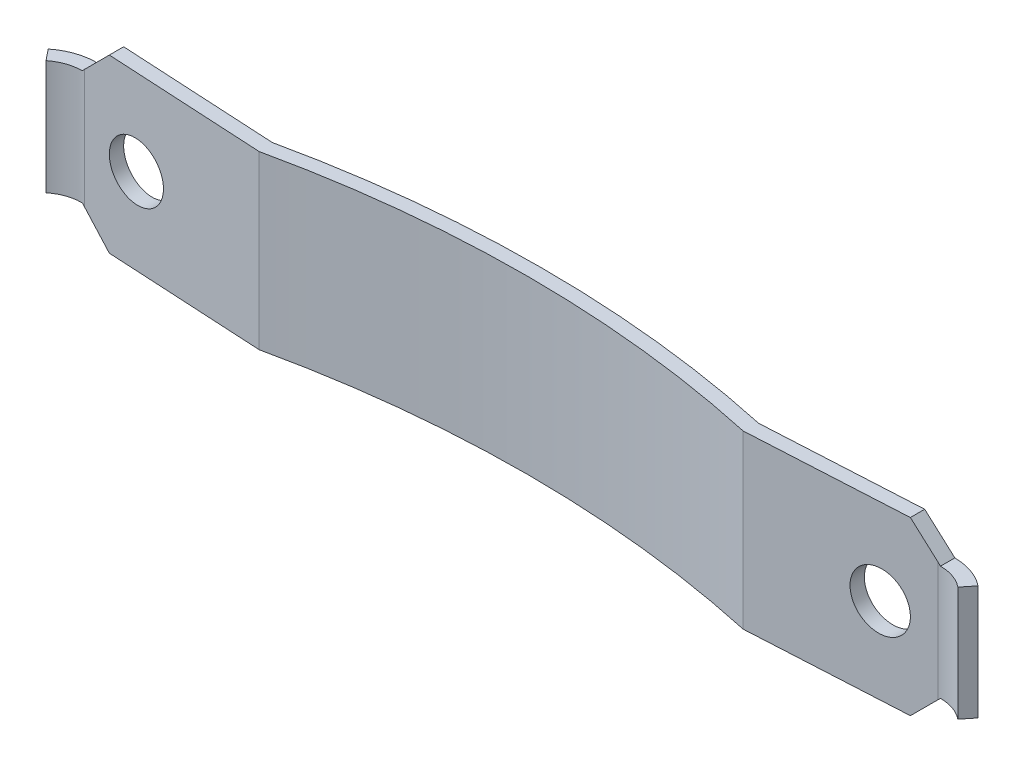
ISO-10303-21;
HEADER;
FILE_DESCRIPTION(('STEP AP214'),'2;1');
FILE_NAME('part.step','',(''),(''),'','','');
FILE_SCHEMA(('AUTOMOTIVE_DESIGN { 1 0 10303 214 1 1 1 1 }'));
ENDSEC;
DATA;
#1=APPLICATION_CONTEXT('core data for automotive mechanical design processes');
#2=APPLICATION_PROTOCOL_DEFINITION('international standard','automotive_design',2000,#1);
#3=PRODUCT_CONTEXT('',#1,'mechanical');
#4=PRODUCT('Part','Part','',(#3));
#5=PRODUCT_RELATED_PRODUCT_CATEGORY('part','',(#4));
#6=PRODUCT_DEFINITION_FORMATION('','',#4);
#7=PRODUCT_DEFINITION_CONTEXT('part definition',#1,'design');
#8=PRODUCT_DEFINITION('design','',#6,#7);
#9=PRODUCT_DEFINITION_SHAPE('','',#8);
#10=(LENGTH_UNIT() NAMED_UNIT(*) SI_UNIT(.MILLI.,.METRE.));
#11=(NAMED_UNIT(*) PLANE_ANGLE_UNIT() SI_UNIT($,.RADIAN.));
#12=(NAMED_UNIT(*) SI_UNIT($,.STERADIAN.) SOLID_ANGLE_UNIT());
#13=UNCERTAINTY_MEASURE_WITH_UNIT(LENGTH_MEASURE(1.E-05),#10,'distance_accuracy_value','');
#14=(GEOMETRIC_REPRESENTATION_CONTEXT(3) GLOBAL_UNCERTAINTY_ASSIGNED_CONTEXT((#13)) GLOBAL_UNIT_ASSIGNED_CONTEXT((#10,
#11,#12)) REPRESENTATION_CONTEXT('',''));
#15=CARTESIAN_POINT('',(0.,0.,0.));
#16=DIRECTION('',(0.,0.,1.));
#17=DIRECTION('',(1.,0.,0.));
#18=AXIS2_PLACEMENT_3D('',#15,#16,#17);
#19=CARTESIAN_POINT('',(15.,3.,1.5612494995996));
#20=DIRECTION('',(0.,-1.,0.));
#21=DIRECTION('',(0.,0.,-1.));
#22=AXIS2_PLACEMENT_3D('',#19,#20,#21);
#23=CYLINDRICAL_SURFACE('',#22,1.5);
#24=CARTESIAN_POINT('',(15.,2.,1.5612494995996));
#25=DIRECTION('',(0.,-1.,0.));
#26=DIRECTION('',(0.,0.,-1.));
#27=AXIS2_PLACEMENT_3D('',#24,#25,#26);
#28=CIRCLE('',#27,1.5);
#29=CARTESIAN_POINT('',(15.9375,2.,0.3903123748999));
#30=VERTEX_POINT('',#29);
#31=CARTESIAN_POINT('',(15.,2.,0.0612494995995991));
#32=VERTEX_POINT('',#31);
#33=EDGE_CURVE('E239',#30,#32,#28,.F.);
#34=ORIENTED_EDGE('',*,*,#33,.T.);
#35=CARTESIAN_POINT('',(15.,2.,1.5612494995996));
#36=DIRECTION('',(-0.707106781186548,-0.707106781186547,0.));
#37=DIRECTION('',(0.707106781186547,-0.707106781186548,0.));
#38=AXIS2_PLACEMENT_3D('',#35,#36,#37);
#39=ELLIPSE('',#38,2.12132034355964,1.5);
#40=CARTESIAN_POINT('',(14.9181314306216,2.08186856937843,0.0634853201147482));
#41=VERTEX_POINT('',#40);
#42=EDGE_CURVE('E179',#32,#41,#39,.F.);
#43=ORIENTED_EDGE('',*,*,#42,.T.);
#44=DIRECTION('',(0.,-1.,0.));
#45=VECTOR('',#44,1.);
#46=CARTESIAN_POINT('',(14.9181314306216,3.,0.0634853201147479));
#47=LINE('',#46,#45);
#48=CARTESIAN_POINT('',(14.9181314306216,-2.08186856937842,0.0634853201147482));
#49=VERTEX_POINT('',#48);
#50=EDGE_CURVE('E178',#41,#49,#47,.T.);
#51=ORIENTED_EDGE('',*,*,#50,.T.);
#52=CARTESIAN_POINT('',(15.,-2.,1.5612494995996));
#53=DIRECTION('',(-0.707106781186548,0.707106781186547,0.));
#54=DIRECTION('',(-0.707106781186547,-0.707106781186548,0.));
#55=AXIS2_PLACEMENT_3D('',#52,#53,#54);
#56=ELLIPSE('',#55,2.12132034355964,1.5);
#57=CARTESIAN_POINT('',(15.,-2.,0.0612494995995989));
#58=VERTEX_POINT('',#57);
#59=EDGE_CURVE('E246',#49,#58,#56,.F.);
#60=ORIENTED_EDGE('',*,*,#59,.T.);
#61=CARTESIAN_POINT('',(15.,-2.,1.5612494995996));
#62=DIRECTION('',(0.,1.,0.));
#63=DIRECTION('',(0.,0.,1.));
#64=AXIS2_PLACEMENT_3D('',#61,#62,#63);
#65=CIRCLE('',#64,1.5);
#66=CARTESIAN_POINT('',(15.9375,-2.,0.3903123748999));
#67=VERTEX_POINT('',#66);
#68=EDGE_CURVE('E257',#58,#67,#65,.F.);
#69=ORIENTED_EDGE('',*,*,#68,.T.);
#70=DIRECTION('',(0.,-1.,0.));
#71=VECTOR('',#70,1.);
#72=CARTESIAN_POINT('',(15.9375,3.,0.3903123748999));
#73=LINE('',#72,#71);
#74=EDGE_CURVE('E200',#30,#67,#73,.T.);
#75=ORIENTED_EDGE('',*,*,#74,.F.);
#76=EDGE_LOOP('',(#34,#43,#51,#60,#69,#75));
#77=FACE_BOUND('',#76,.T.);
#78=ADVANCED_FACE('F27',(#77),#23,.F.);
#79=CARTESIAN_POINT('',(16.25,3.,0.));
#80=DIRECTION('',(0.780624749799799,0.,0.625000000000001));
#81=DIRECTION('',(0.625000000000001,0.,-0.780624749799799));
#82=AXIS2_PLACEMENT_3D('',#79,#80,#81);
#83=PLANE('',#82);
#84=DIRECTION('',(0.625000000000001,0.,-0.780624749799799));
#85=VECTOR('',#84,1.);
#86=CARTESIAN_POINT('',(16.25,2.,0.));
#87=LINE('',#86,#85);
#88=CARTESIAN_POINT('',(16.25,2.,0.));
#89=VERTEX_POINT('',#88);
#90=EDGE_CURVE('E237',#30,#89,#87,.T.);
#91=ORIENTED_EDGE('',*,*,#90,.F.);
#92=ORIENTED_EDGE('',*,*,#74,.T.);
#93=DIRECTION('',(-0.625000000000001,0.,0.780624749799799));
#94=VECTOR('',#93,1.);
#95=CARTESIAN_POINT('',(16.25,-2.,0.));
#96=LINE('',#95,#94);
#97=CARTESIAN_POINT('',(16.25,-2.,0.));
#98=VERTEX_POINT('',#97);
#99=EDGE_CURVE('E254',#98,#67,#96,.T.);
#100=ORIENTED_EDGE('',*,*,#99,.F.);
#101=DIRECTION('',(0.,-1.,0.));
#102=VECTOR('',#101,1.);
#103=CARTESIAN_POINT('',(16.25,3.,0.));
#104=LINE('',#103,#102);
#105=EDGE_CURVE('E198',#89,#98,#104,.T.);
#106=ORIENTED_EDGE('',*,*,#105,.F.);
#107=EDGE_LOOP('',(#91,#92,#100,#106));
#108=FACE_BOUND('',#107,.T.);
#109=ADVANCED_FACE('F400',(#108),#83,.T.);
#110=CARTESIAN_POINT('',(15.,3.,1.5612494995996));
#111=DIRECTION('',(0.,-1.,0.));
#112=DIRECTION('',(0.,0.,-1.));
#113=AXIS2_PLACEMENT_3D('',#110,#111,#112);
#114=CYLINDRICAL_SURFACE('',#113,2.);
#115=CARTESIAN_POINT('',(15.,2.,1.5612494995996));
#116=DIRECTION('',(-0.707106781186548,-0.707106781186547,0.));
#117=DIRECTION('',(0.707106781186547,-0.707106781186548,0.));
#118=AXIS2_PLACEMENT_3D('',#115,#116,#117);
#119=ELLIPSE('',#118,2.82842712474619,2.);
#120=CARTESIAN_POINT('',(15.,2.,-0.438750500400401));
#121=VERTEX_POINT('',#120);
#122=CARTESIAN_POINT('',(14.8908419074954,2.10915809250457,-0.435769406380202));
#123=VERTEX_POINT('',#122);
#124=EDGE_CURVE('E235',#121,#123,#119,.F.);
#125=ORIENTED_EDGE('',*,*,#124,.F.);
#126=CARTESIAN_POINT('',(15.,2.,1.5612494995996));
#127=DIRECTION('',(0.,-1.,0.));
#128=DIRECTION('',(0.,0.,-1.));
#129=AXIS2_PLACEMENT_3D('',#126,#127,#128);
#130=CIRCLE('',#129,2.);
#131=EDGE_CURVE('E11',#89,#121,#130,.F.);
#132=ORIENTED_EDGE('',*,*,#131,.F.);
#133=ORIENTED_EDGE('',*,*,#105,.T.);
#134=CARTESIAN_POINT('',(15.,-2.,1.5612494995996));
#135=DIRECTION('',(0.,1.,0.));
#136=DIRECTION('',(0.,0.,1.));
#137=AXIS2_PLACEMENT_3D('',#134,#135,#136);
#138=CIRCLE('',#137,2.);
#139=CARTESIAN_POINT('',(15.,-2.,-0.438750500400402));
#140=VERTEX_POINT('',#139);
#141=EDGE_CURVE('E170',#140,#98,#138,.F.);
#142=ORIENTED_EDGE('',*,*,#141,.F.);
#143=CARTESIAN_POINT('',(15.,-2.,1.5612494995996));
#144=DIRECTION('',(-0.707106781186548,0.707106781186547,0.));
#145=DIRECTION('',(-0.707106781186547,-0.707106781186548,0.));
#146=AXIS2_PLACEMENT_3D('',#143,#144,#145);
#147=ELLIPSE('',#146,2.82842712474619,2.);
#148=CARTESIAN_POINT('',(14.8908419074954,-2.10915809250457,-0.435769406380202));
#149=VERTEX_POINT('',#148);
#150=EDGE_CURVE('E252',#149,#140,#147,.F.);
#151=ORIENTED_EDGE('',*,*,#150,.F.);
#152=DIRECTION('',(0.,-1.,0.));
#153=VECTOR('',#152,1.);
#154=CARTESIAN_POINT('',(14.8908419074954,3.,-0.435769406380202));
#155=LINE('',#154,#153);
#156=EDGE_CURVE('E196',#123,#149,#155,.T.);
#157=ORIENTED_EDGE('',*,*,#156,.F.);
#158=EDGE_LOOP('',(#125,#132,#133,#142,#151,#157));
#159=FACE_BOUND('',#158,.T.);
#160=ADVANCED_FACE('F392',(#159),#114,.T.);
#161=CARTESIAN_POINT('',(8.5,3.,-0.086442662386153));
#162=DIRECTION('',(-0.0545790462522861,0.,-0.998509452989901));
#163=DIRECTION('',(-0.998509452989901,0.,0.0545790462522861));
#164=AXIS2_PLACEMENT_3D('',#161,#162,#163);
#165=PLANE('',#164);
#166=CARTESIAN_POINT('',(13.,0.,-0.332415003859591));
#167=DIRECTION('',(-0.0545790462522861,0.,-0.998509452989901));
#168=DIRECTION('',(-0.998509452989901,0.,0.0545790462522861));
#169=AXIS2_PLACEMENT_3D('',#166,#167,#168);
#170=ELLIPSE('',#169,1.00149277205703,1.);
#171=CARTESIAN_POINT('',(12.,0.,-0.27775448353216));
#172=VERTEX_POINT('',#171);
#173=EDGE_CURVE('E220',#172,#172,#170,.T.);
#174=ORIENTED_EDGE('',*,*,#173,.F.);
#175=EDGE_LOOP('',(#174));
#176=FACE_BOUND('',#175,.T.);
#177=DIRECTION('',(-0.706579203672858,0.706579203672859,0.0386219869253));
#178=VECTOR('',#177,1.);
#179=CARTESIAN_POINT('',(11.2458979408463,5.75410205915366,-0.236534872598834));
#180=LINE('',#179,#178);
#181=CARTESIAN_POINT('',(14.,3.,-0.387075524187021));
#182=VERTEX_POINT('',#181);
#183=EDGE_CURVE('E43',#123,#182,#180,.T.);
#184=ORIENTED_EDGE('',*,*,#183,.F.);
#185=ORIENTED_EDGE('',*,*,#156,.T.);
#186=DIRECTION('',(0.706579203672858,0.706579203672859,-0.0386219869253));
#187=VECTOR('',#186,1.);
#188=CARTESIAN_POINT('',(14.2414229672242,-2.75857703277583,-0.400271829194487));
#189=LINE('',#188,#187);
#190=CARTESIAN_POINT('',(14.,-3.,-0.387075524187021));
#191=VERTEX_POINT('',#190);
#192=EDGE_CURVE('E249',#191,#149,#189,.T.);
#193=ORIENTED_EDGE('',*,*,#192,.F.);
#194=DIRECTION('',(0.998509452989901,0.,-0.0545790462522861));
#195=VECTOR('',#194,1.);
#196=CARTESIAN_POINT('',(8.5,-3.,-0.086442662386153));
#197=LINE('',#196,#195);
#198=CARTESIAN_POINT('',(8.5,-3.,-0.0864426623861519));
#199=VERTEX_POINT('',#198);
#200=EDGE_CURVE('E325',#199,#191,#197,.T.);
#201=ORIENTED_EDGE('',*,*,#200,.F.);
#202=DIRECTION('',(0.,-1.,0.));
#203=VECTOR('',#202,1.);
#204=CARTESIAN_POINT('',(8.5,3.,-0.0864426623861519));
#205=LINE('',#204,#203);
#206=CARTESIAN_POINT('',(8.5,3.,-0.0864426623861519));
#207=VERTEX_POINT('',#206);
#208=EDGE_CURVE('E194',#207,#199,#205,.T.);
#209=ORIENTED_EDGE('',*,*,#208,.F.);
#210=DIRECTION('',(0.998509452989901,0.,-0.0545790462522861));
#211=VECTOR('',#210,1.);
#212=CARTESIAN_POINT('',(8.5,3.,-0.086442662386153));
#213=LINE('',#212,#211);
#214=EDGE_CURVE('E336',#207,#182,#213,.T.);
#215=ORIENTED_EDGE('',*,*,#214,.T.);
#216=EDGE_LOOP('',(#184,#185,#193,#201,#209,#215));
#217=FACE_BOUND('',#216,.T.);
#218=ADVANCED_FACE('F344',(#176,#217),#165,.T.);
#219=CARTESIAN_POINT('',(0.,3.,39.));
#220=DIRECTION('',(0.,-1.,0.));
#221=DIRECTION('',(0.,0.,-1.));
#222=AXIS2_PLACEMENT_3D('',#219,#220,#221);
#223=CYLINDRICAL_SURFACE('',#222,40.);
#224=CARTESIAN_POINT('',(0.,-3.,39.));
#225=DIRECTION('',(0.,-1.,0.));
#226=DIRECTION('',(0.,0.,1.));
#227=AXIS2_PLACEMENT_3D('',#224,#225,#226);
#228=CIRCLE('',#227,40.);
#229=CARTESIAN_POINT('',(-8.5,-3.,-0.0864426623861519));
#230=VERTEX_POINT('',#229);
#231=EDGE_CURVE('E328',#230,#199,#228,.T.);
#232=ORIENTED_EDGE('',*,*,#231,.F.);
#233=DIRECTION('',(0.,-1.,0.));
#234=VECTOR('',#233,1.);
#235=CARTESIAN_POINT('',(-8.5,3.,-0.0864426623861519));
#236=LINE('',#235,#234);
#237=CARTESIAN_POINT('',(-8.5,3.,-0.0864426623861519));
#238=VERTEX_POINT('',#237);
#239=EDGE_CURVE('E316',#238,#230,#236,.T.);
#240=ORIENTED_EDGE('',*,*,#239,.F.);
#241=CARTESIAN_POINT('',(0.,3.,39.));
#242=DIRECTION('',(0.,-1.,0.));
#243=DIRECTION('',(0.,0.,1.));
#244=AXIS2_PLACEMENT_3D('',#241,#242,#243);
#245=CIRCLE('',#244,40.);
#246=EDGE_CURVE('E189',#238,#207,#245,.T.);
#247=ORIENTED_EDGE('',*,*,#246,.T.);
#248=ORIENTED_EDGE('',*,*,#208,.T.);
#249=EDGE_LOOP('',(#232,#240,#247,#248));
#250=FACE_BOUND('',#249,.T.);
#251=ADVANCED_FACE('F340',(#250),#223,.T.);
#252=CARTESIAN_POINT('',(0.,3.,39.));
#253=DIRECTION('',(0.,-1.,0.));
#254=DIRECTION('',(0.,0.,-1.));
#255=AXIS2_PLACEMENT_3D('',#252,#253,#254);
#256=CYLINDRICAL_SURFACE('',#255,39.5);
#257=CARTESIAN_POINT('',(0.,-3.,39.));
#258=DIRECTION('',(0.,1.,0.));
#259=DIRECTION('',(1.,0.,0.));
#260=AXIS2_PLACEMENT_3D('',#257,#258,#259);
#261=CIRCLE('',#260,39.5);
#262=CARTESIAN_POINT('',(-8.45958212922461,-3.,0.416512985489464));
#263=VERTEX_POINT('',#262);
#264=CARTESIAN_POINT('',(8.45958212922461,-3.,0.416512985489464));
#265=VERTEX_POINT('',#264);
#266=EDGE_CURVE('E331',#263,#265,#261,.F.);
#267=ORIENTED_EDGE('',*,*,#266,.T.);
#268=DIRECTION('',(0.,-1.,0.));
#269=VECTOR('',#268,1.);
#270=CARTESIAN_POINT('',(8.45958212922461,3.,0.416512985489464));
#271=LINE('',#270,#269);
#272=CARTESIAN_POINT('',(8.45958212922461,3.,0.416512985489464));
#273=VERTEX_POINT('',#272);
#274=EDGE_CURVE('E187',#273,#265,#271,.T.);
#275=ORIENTED_EDGE('',*,*,#274,.F.);
#276=CARTESIAN_POINT('',(0.,3.,39.));
#277=DIRECTION('',(0.,1.,0.));
#278=DIRECTION('',(1.,0.,0.));
#279=AXIS2_PLACEMENT_3D('',#276,#277,#278);
#280=CIRCLE('',#279,39.5);
#281=CARTESIAN_POINT('',(-8.45958212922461,3.,0.416512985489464));
#282=VERTEX_POINT('',#281);
#283=EDGE_CURVE('E184',#282,#273,#280,.F.);
#284=ORIENTED_EDGE('',*,*,#283,.F.);
#285=DIRECTION('',(0.,-1.,0.));
#286=VECTOR('',#285,1.);
#287=CARTESIAN_POINT('',(-8.45958212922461,3.,0.416512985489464));
#288=LINE('',#287,#286);
#289=EDGE_CURVE('E319',#282,#263,#288,.T.);
#290=ORIENTED_EDGE('',*,*,#289,.T.);
#291=EDGE_LOOP('',(#267,#275,#284,#290));
#292=FACE_BOUND('',#291,.T.);
#293=ADVANCED_FACE('F385',(#292),#256,.F.);
#294=CARTESIAN_POINT('',(8.52728952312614,3.,0.412812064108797));
#295=DIRECTION('',(-0.0545790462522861,0.,-0.998509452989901));
#296=DIRECTION('',(-0.998509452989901,0.,0.0545790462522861));
#297=AXIS2_PLACEMENT_3D('',#294,#295,#296);
#298=PLANE('',#297);
#299=CARTESIAN_POINT('',(13.,0.,0.168331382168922));
#300=DIRECTION('',(-0.0545790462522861,0.,-0.998509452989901));
#301=DIRECTION('',(-0.998509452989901,0.,0.0545790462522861));
#302=AXIS2_PLACEMENT_3D('',#299,#300,#301);
#303=ELLIPSE('',#302,1.00149277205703,1.);
#304=CARTESIAN_POINT('',(12.,0.,0.222991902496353));
#305=VERTEX_POINT('',#304);
#306=EDGE_CURVE('E30',#305,#305,#303,.T.);
#307=ORIENTED_EDGE('',*,*,#306,.T.);
#308=EDGE_LOOP('',(#307));
#309=FACE_BOUND('',#308,.T.);
#310=ORIENTED_EDGE('',*,*,#50,.F.);
#311=DIRECTION('',(-0.706579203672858,0.706579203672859,0.0386219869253));
#312=VECTOR('',#311,1.);
#313=CARTESIAN_POINT('',(11.2595630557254,5.74043694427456,0.263464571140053));
#314=LINE('',#313,#312);
#315=CARTESIAN_POINT('',(14.,3.,0.113670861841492));
#316=VERTEX_POINT('',#315);
#317=EDGE_CURVE('E164',#41,#316,#314,.T.);
#318=ORIENTED_EDGE('',*,*,#317,.T.);
#319=DIRECTION('',(0.998509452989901,0.,-0.0545790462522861));
#320=VECTOR('',#319,1.);
#321=CARTESIAN_POINT('',(8.52728952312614,3.,0.412812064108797));
#322=LINE('',#321,#320);
#323=EDGE_CURVE('E177',#273,#316,#322,.T.);
#324=ORIENTED_EDGE('',*,*,#323,.F.);
#325=ORIENTED_EDGE('',*,*,#274,.T.);
#326=DIRECTION('',(0.998509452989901,0.,-0.0545790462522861));
#327=VECTOR('',#326,1.);
#328=CARTESIAN_POINT('',(8.52728952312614,-3.,0.412812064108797));
#329=LINE('',#328,#327);
#330=CARTESIAN_POINT('',(14.,-3.,0.113670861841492));
#331=VERTEX_POINT('',#330);
#332=EDGE_CURVE('E333',#265,#331,#329,.T.);
#333=ORIENTED_EDGE('',*,*,#332,.T.);
#334=DIRECTION('',(0.706579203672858,0.706579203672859,-0.0386219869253));
#335=VECTOR('',#334,1.);
#336=CARTESIAN_POINT('',(14.2550880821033,-2.74491191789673,0.0997276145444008));
#337=LINE('',#336,#335);
#338=EDGE_CURVE('E51',#331,#49,#337,.T.);
#339=ORIENTED_EDGE('',*,*,#338,.T.);
#340=EDGE_LOOP('',(#310,#318,#324,#325,#333,#339));
#341=FACE_BOUND('',#340,.T.);
#342=ADVANCED_FACE('F175',(#309,#341),#298,.F.);
#343=CARTESIAN_POINT('',(15.,3.,1.5612494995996));
#344=DIRECTION('',(0.,1.,0.));
#345=DIRECTION('',(0.,0.,1.));
#346=AXIS2_PLACEMENT_3D('',#343,#344,#345);
#347=PLANE('',#346);
#348=DIRECTION('',(0.,0.,1.));
#349=VECTOR('',#348,1.);
#350=CARTESIAN_POINT('',(14.,3.,1.5612494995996));
#351=LINE('',#350,#349);
#352=EDGE_CURVE('E35',#182,#316,#351,.T.);
#353=ORIENTED_EDGE('',*,*,#352,.F.);
#354=ORIENTED_EDGE('',*,*,#214,.F.);
#355=ORIENTED_EDGE('',*,*,#246,.F.);
#356=DIRECTION('',(-0.998509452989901,0.,-0.0545790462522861));
#357=VECTOR('',#356,1.);
#358=CARTESIAN_POINT('',(-8.5,3.,-0.086442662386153));
#359=LINE('',#358,#357);
#360=CARTESIAN_POINT('',(-14.,3.,-0.387075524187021));
#361=VERTEX_POINT('',#360);
#362=EDGE_CURVE('E304',#238,#361,#359,.T.);
#363=ORIENTED_EDGE('',*,*,#362,.T.);
#364=DIRECTION('',(0.,0.,1.));
#365=VECTOR('',#364,1.);
#366=CARTESIAN_POINT('',(-14.,3.,-3.));
#367=LINE('',#366,#365);
#368=CARTESIAN_POINT('',(-14.,3.,0.113670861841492));
#369=VERTEX_POINT('',#368);
#370=EDGE_CURVE('E278',#361,#369,#367,.T.);
#371=ORIENTED_EDGE('',*,*,#370,.T.);
#372=DIRECTION('',(-0.998509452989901,0.,-0.0545790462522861));
#373=VECTOR('',#372,1.);
#374=CARTESIAN_POINT('',(-8.52728952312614,3.,0.412812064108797));
#375=LINE('',#374,#373);
#376=EDGE_CURVE('E301',#282,#369,#375,.T.);
#377=ORIENTED_EDGE('',*,*,#376,.F.);
#378=ORIENTED_EDGE('',*,*,#283,.T.);
#379=ORIENTED_EDGE('',*,*,#323,.T.);
#380=EDGE_LOOP('',(#353,#354,#355,#363,#371,#377,#378,#379));
#381=FACE_BOUND('',#380,.T.);
#382=ADVANCED_FACE('F182',(#381),#347,.T.);
#383=CARTESIAN_POINT('',(15.,-3.,1.5612494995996));
#384=DIRECTION('',(0.,1.,0.));
#385=DIRECTION('',(0.,0.,1.));
#386=AXIS2_PLACEMENT_3D('',#383,#384,#385);
#387=PLANE('',#386);
#388=ORIENTED_EDGE('',*,*,#200,.T.);
#389=DIRECTION('',(0.,0.,1.));
#390=VECTOR('',#389,1.);
#391=CARTESIAN_POINT('',(14.,-3.,1.5612494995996));
#392=LINE('',#391,#390);
#393=EDGE_CURVE('E214',#191,#331,#392,.T.);
#394=ORIENTED_EDGE('',*,*,#393,.T.);
#395=ORIENTED_EDGE('',*,*,#332,.F.);
#396=ORIENTED_EDGE('',*,*,#266,.F.);
#397=DIRECTION('',(-0.998509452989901,0.,-0.0545790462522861));
#398=VECTOR('',#397,1.);
#399=CARTESIAN_POINT('',(-8.52728952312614,-3.,0.412812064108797));
#400=LINE('',#399,#398);
#401=CARTESIAN_POINT('',(-14.,-3.,0.113670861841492));
#402=VERTEX_POINT('',#401);
#403=EDGE_CURVE('E295',#263,#402,#400,.T.);
#404=ORIENTED_EDGE('',*,*,#403,.T.);
#405=DIRECTION('',(0.,0.,1.));
#406=VECTOR('',#405,1.);
#407=CARTESIAN_POINT('',(-14.,-3.,-3.));
#408=LINE('',#407,#406);
#409=CARTESIAN_POINT('',(-14.,-3.,-0.387075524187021));
#410=VERTEX_POINT('',#409);
#411=EDGE_CURVE('E261',#410,#402,#408,.T.);
#412=ORIENTED_EDGE('',*,*,#411,.F.);
#413=DIRECTION('',(-0.998509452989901,0.,-0.0545790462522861));
#414=VECTOR('',#413,1.);
#415=CARTESIAN_POINT('',(-8.5,-3.,-0.086442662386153));
#416=LINE('',#415,#414);
#417=EDGE_CURVE('E298',#230,#410,#416,.T.);
#418=ORIENTED_EDGE('',*,*,#417,.F.);
#419=ORIENTED_EDGE('',*,*,#231,.T.);
#420=EDGE_LOOP('',(#388,#394,#395,#396,#404,#412,#418,#419));
#421=FACE_BOUND('',#420,.T.);
#422=ADVANCED_FACE('F349',(#421),#387,.F.);
#423=CARTESIAN_POINT('',(-15.,3.,1.5612494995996));
#424=DIRECTION('',(0.,-1.,0.));
#425=DIRECTION('',(0.,0.,-1.));
#426=AXIS2_PLACEMENT_3D('',#423,#424,#425);
#427=CYLINDRICAL_SURFACE('',#426,1.5);
#428=CARTESIAN_POINT('',(-15.,-2.,1.5612494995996));
#429=DIRECTION('',(0.707106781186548,0.707106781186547,0.));
#430=DIRECTION('',(0.707106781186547,-0.707106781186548,0.));
#431=AXIS2_PLACEMENT_3D('',#428,#429,#430);
#432=ELLIPSE('',#431,2.12132034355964,1.5);
#433=CARTESIAN_POINT('',(-14.9181314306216,-2.08186856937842,0.0634853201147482));
#434=VERTEX_POINT('',#433);
#435=CARTESIAN_POINT('',(-15.,-2.,0.0612494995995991));
#436=VERTEX_POINT('',#435);
#437=EDGE_CURVE('E275',#434,#436,#432,.T.);
#438=ORIENTED_EDGE('',*,*,#437,.F.);
#439=DIRECTION('',(0.,-1.,0.));
#440=VECTOR('',#439,1.);
#441=CARTESIAN_POINT('',(-14.9181314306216,3.,0.0634853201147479));
#442=LINE('',#441,#440);
#443=CARTESIAN_POINT('',(-14.9181314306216,2.08186856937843,0.0634853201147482));
#444=VERTEX_POINT('',#443);
#445=EDGE_CURVE('E322',#444,#434,#442,.T.);
#446=ORIENTED_EDGE('',*,*,#445,.F.);
#447=CARTESIAN_POINT('',(-15.,2.,1.5612494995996));
#448=DIRECTION('',(0.707106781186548,-0.707106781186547,0.));
#449=DIRECTION('',(-0.707106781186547,-0.707106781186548,0.));
#450=AXIS2_PLACEMENT_3D('',#447,#448,#449);
#451=ELLIPSE('',#450,2.12132034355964,1.5);
#452=CARTESIAN_POINT('',(-15.,2.,0.0612494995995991));
#453=VERTEX_POINT('',#452);
#454=EDGE_CURVE('E293',#453,#444,#451,.T.);
#455=ORIENTED_EDGE('',*,*,#454,.F.);
#456=CARTESIAN_POINT('',(-15.,2.,1.5612494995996));
#457=DIRECTION('',(0.,-1.,0.));
#458=DIRECTION('',(0.,0.,-1.));
#459=AXIS2_PLACEMENT_3D('',#456,#457,#458);
#460=CIRCLE('',#459,1.5);
#461=CARTESIAN_POINT('',(-15.9375,2.,0.3903123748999));
#462=VERTEX_POINT('',#461);
#463=EDGE_CURVE('E286',#462,#453,#460,.T.);
#464=ORIENTED_EDGE('',*,*,#463,.F.);
#465=DIRECTION('',(0.,-1.,0.));
#466=VECTOR('',#465,1.);
#467=CARTESIAN_POINT('',(-15.9375,3.,0.3903123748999));
#468=LINE('',#467,#466);
#469=CARTESIAN_POINT('',(-15.9375,-2.,0.3903123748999));
#470=VERTEX_POINT('',#469);
#471=EDGE_CURVE('E307',#462,#470,#468,.T.);
#472=ORIENTED_EDGE('',*,*,#471,.T.);
#473=CARTESIAN_POINT('',(-15.,-2.,1.5612494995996));
#474=DIRECTION('',(0.,1.,0.));
#475=DIRECTION('',(0.,0.,1.));
#476=AXIS2_PLACEMENT_3D('',#473,#474,#475);
#477=CIRCLE('',#476,1.5);
#478=EDGE_CURVE('E268',#436,#470,#477,.T.);
#479=ORIENTED_EDGE('',*,*,#478,.F.);
#480=EDGE_LOOP('',(#438,#446,#455,#464,#472,#479));
#481=FACE_BOUND('',#480,.T.);
#482=ADVANCED_FACE('F369',(#481),#427,.F.);
#483=CARTESIAN_POINT('',(-8.52728952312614,3.,0.412812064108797));
#484=DIRECTION('',(-0.0545790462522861,0.,0.998509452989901));
#485=DIRECTION('',(0.998509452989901,0.,0.0545790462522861));
#486=AXIS2_PLACEMENT_3D('',#483,#484,#485);
#487=PLANE('',#486);
#488=CARTESIAN_POINT('',(-13.,0.,0.168331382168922));
#489=DIRECTION('',(-0.0545790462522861,0.,0.998509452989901));
#490=DIRECTION('',(0.998509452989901,0.,0.0545790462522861));
#491=AXIS2_PLACEMENT_3D('',#488,#489,#490);
#492=ELLIPSE('',#491,1.00149277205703,1.);
#493=CARTESIAN_POINT('',(-12.,0.,0.222991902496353));
#494=VERTEX_POINT('',#493);
#495=EDGE_CURVE('E219',#494,#494,#492,.T.);
#496=ORIENTED_EDGE('',*,*,#495,.F.);
#497=EDGE_LOOP('',(#496));
#498=FACE_BOUND('',#497,.T.);
#499=DIRECTION('',(-0.706579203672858,0.706579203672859,-0.0386219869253));
#500=VECTOR('',#499,1.);
#501=CARTESIAN_POINT('',(-14.2550880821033,-2.74491191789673,0.0997276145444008));
#502=LINE('',#501,#500);
#503=EDGE_CURVE('E273',#402,#434,#502,.T.);
#504=ORIENTED_EDGE('',*,*,#503,.F.);
#505=ORIENTED_EDGE('',*,*,#403,.F.);
#506=ORIENTED_EDGE('',*,*,#289,.F.);
#507=ORIENTED_EDGE('',*,*,#376,.T.);
#508=DIRECTION('',(0.706579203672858,0.706579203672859,0.0386219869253));
#509=VECTOR('',#508,1.);
#510=CARTESIAN_POINT('',(-11.2595630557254,5.74043694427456,0.263464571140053));
#511=LINE('',#510,#509);
#512=EDGE_CURVE('E291',#444,#369,#511,.T.);
#513=ORIENTED_EDGE('',*,*,#512,.F.);
#514=ORIENTED_EDGE('',*,*,#445,.T.);
#515=EDGE_LOOP('',(#504,#505,#506,#507,#513,#514));
#516=FACE_BOUND('',#515,.T.);
#517=ADVANCED_FACE('F375',(#498,#516),#487,.T.);
#518=CARTESIAN_POINT('',(-8.5,3.,-0.086442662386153));
#519=DIRECTION('',(-0.0545790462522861,0.,0.998509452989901));
#520=DIRECTION('',(0.998509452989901,0.,0.0545790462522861));
#521=AXIS2_PLACEMENT_3D('',#518,#519,#520);
#522=PLANE('',#521);
#523=CARTESIAN_POINT('',(-13.,0.,-0.332415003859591));
#524=DIRECTION('',(-0.0545790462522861,0.,0.998509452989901));
#525=DIRECTION('',(0.998509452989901,0.,0.0545790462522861));
#526=AXIS2_PLACEMENT_3D('',#523,#524,#525);
#527=ELLIPSE('',#526,1.00149277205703,1.);
#528=CARTESIAN_POINT('',(-12.,0.,-0.27775448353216));
#529=VERTEX_POINT('',#528);
#530=EDGE_CURVE('E217',#529,#529,#527,.T.);
#531=ORIENTED_EDGE('',*,*,#530,.T.);
#532=EDGE_LOOP('',(#531));
#533=FACE_BOUND('',#532,.T.);
#534=ORIENTED_EDGE('',*,*,#417,.T.);
#535=DIRECTION('',(-0.706579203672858,0.706579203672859,-0.0386219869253));
#536=VECTOR('',#535,1.);
#537=CARTESIAN_POINT('',(-14.2414229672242,-2.75857703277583,-0.400271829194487));
#538=LINE('',#537,#536);
#539=CARTESIAN_POINT('',(-14.8908419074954,-2.10915809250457,-0.435769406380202));
#540=VERTEX_POINT('',#539);
#541=EDGE_CURVE('E270',#410,#540,#538,.T.);
#542=ORIENTED_EDGE('',*,*,#541,.T.);
#543=DIRECTION('',(0.,-1.,0.));
#544=VECTOR('',#543,1.);
#545=CARTESIAN_POINT('',(-14.8908419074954,3.,-0.435769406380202));
#546=LINE('',#545,#544);
#547=CARTESIAN_POINT('',(-14.8908419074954,2.10915809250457,-0.435769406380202));
#548=VERTEX_POINT('',#547);
#549=EDGE_CURVE('E313',#548,#540,#546,.T.);
#550=ORIENTED_EDGE('',*,*,#549,.F.);
#551=DIRECTION('',(0.706579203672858,0.706579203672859,0.0386219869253));
#552=VECTOR('',#551,1.);
#553=CARTESIAN_POINT('',(-11.2458979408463,5.75410205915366,-0.236534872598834));
#554=LINE('',#553,#552);
#555=EDGE_CURVE('E288',#548,#361,#554,.T.);
#556=ORIENTED_EDGE('',*,*,#555,.T.);
#557=ORIENTED_EDGE('',*,*,#362,.F.);
#558=ORIENTED_EDGE('',*,*,#239,.T.);
#559=EDGE_LOOP('',(#534,#542,#550,#556,#557,#558));
#560=FACE_BOUND('',#559,.T.);
#561=ADVANCED_FACE('F352',(#533,#560),#522,.F.);
#562=CARTESIAN_POINT('',(-15.,3.,1.5612494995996));
#563=DIRECTION('',(0.,-1.,0.));
#564=DIRECTION('',(0.,0.,-1.));
#565=AXIS2_PLACEMENT_3D('',#562,#563,#564);
#566=CYLINDRICAL_SURFACE('',#565,2.);
#567=ORIENTED_EDGE('',*,*,#549,.T.);
#568=CARTESIAN_POINT('',(-15.,-2.,1.5612494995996));
#569=DIRECTION('',(0.707106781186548,0.707106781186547,0.));
#570=DIRECTION('',(0.707106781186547,-0.707106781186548,0.));
#571=AXIS2_PLACEMENT_3D('',#568,#569,#570);
#572=ELLIPSE('',#571,2.82842712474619,2.);
#573=CARTESIAN_POINT('',(-15.,-2.,-0.438750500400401));
#574=VERTEX_POINT('',#573);
#575=EDGE_CURVE('E211',#540,#574,#572,.T.);
#576=ORIENTED_EDGE('',*,*,#575,.T.);
#577=CARTESIAN_POINT('',(-15.,-2.,1.5612494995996));
#578=DIRECTION('',(0.,1.,0.));
#579=DIRECTION('',(0.,0.,1.));
#580=AXIS2_PLACEMENT_3D('',#577,#578,#579);
#581=CIRCLE('',#580,2.);
#582=CARTESIAN_POINT('',(-16.25,-2.,0.));
#583=VERTEX_POINT('',#582);
#584=EDGE_CURVE('E263',#574,#583,#581,.T.);
#585=ORIENTED_EDGE('',*,*,#584,.T.);
#586=DIRECTION('',(0.,-1.,0.));
#587=VECTOR('',#586,1.);
#588=CARTESIAN_POINT('',(-16.25,3.,0.));
#589=LINE('',#588,#587);
#590=CARTESIAN_POINT('',(-16.25,2.,0.));
#591=VERTEX_POINT('',#590);
#592=EDGE_CURVE('E310',#591,#583,#589,.T.);
#593=ORIENTED_EDGE('',*,*,#592,.F.);
#594=CARTESIAN_POINT('',(-15.,2.,1.5612494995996));
#595=DIRECTION('',(0.,-1.,0.));
#596=DIRECTION('',(0.,0.,-1.));
#597=AXIS2_PLACEMENT_3D('',#594,#595,#596);
#598=CIRCLE('',#597,2.);
#599=CARTESIAN_POINT('',(-15.,2.,-0.438750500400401));
#600=VERTEX_POINT('',#599);
#601=EDGE_CURVE('E281',#591,#600,#598,.T.);
#602=ORIENTED_EDGE('',*,*,#601,.T.);
#603=CARTESIAN_POINT('',(-15.,2.,1.5612494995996));
#604=DIRECTION('',(0.707106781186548,-0.707106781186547,0.));
#605=DIRECTION('',(-0.707106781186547,-0.707106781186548,0.));
#606=AXIS2_PLACEMENT_3D('',#603,#604,#605);
#607=ELLIPSE('',#606,2.82842712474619,2.);
#608=EDGE_CURVE('E205',#600,#548,#607,.T.);
#609=ORIENTED_EDGE('',*,*,#608,.T.);
#610=EDGE_LOOP('',(#567,#576,#585,#593,#602,#609));
#611=FACE_BOUND('',#610,.T.);
#612=ADVANCED_FACE('F358',(#611),#566,.T.);
#613=CARTESIAN_POINT('',(-16.25,3.,0.));
#614=DIRECTION('',(0.780624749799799,0.,-0.625000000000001));
#615=DIRECTION('',(-0.625000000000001,0.,-0.780624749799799));
#616=AXIS2_PLACEMENT_3D('',#613,#614,#615);
#617=PLANE('',#616);
#618=ORIENTED_EDGE('',*,*,#592,.T.);
#619=DIRECTION('',(0.625000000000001,0.,0.780624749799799));
#620=VECTOR('',#619,1.);
#621=CARTESIAN_POINT('',(-16.25,-2.,0.));
#622=LINE('',#621,#620);
#623=EDGE_CURVE('E208',#583,#470,#622,.T.);
#624=ORIENTED_EDGE('',*,*,#623,.T.);
#625=ORIENTED_EDGE('',*,*,#471,.F.);
#626=DIRECTION('',(-0.625000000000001,0.,-0.780624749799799));
#627=VECTOR('',#626,1.);
#628=CARTESIAN_POINT('',(-16.25,2.,0.));
#629=LINE('',#628,#627);
#630=EDGE_CURVE('E202',#462,#591,#629,.T.);
#631=ORIENTED_EDGE('',*,*,#630,.T.);
#632=EDGE_LOOP('',(#618,#624,#625,#631));
#633=FACE_BOUND('',#632,.T.);
#634=ADVANCED_FACE('F365',(#633),#617,.F.);
#635=CARTESIAN_POINT('',(-15.,2.,-3.));
#636=DIRECTION('',(0.707106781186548,-0.707106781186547,0.));
#637=DIRECTION('',(0.707106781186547,0.707106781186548,0.));
#638=AXIS2_PLACEMENT_3D('',#635,#636,#637);
#639=PLANE('',#638);
#640=ORIENTED_EDGE('',*,*,#454,.T.);
#641=ORIENTED_EDGE('',*,*,#512,.T.);
#642=ORIENTED_EDGE('',*,*,#370,.F.);
#643=ORIENTED_EDGE('',*,*,#555,.F.);
#644=ORIENTED_EDGE('',*,*,#608,.F.);
#645=DIRECTION('',(0.,0.,1.));
#646=VECTOR('',#645,1.);
#647=CARTESIAN_POINT('',(-15.,2.,-3.));
#648=LINE('',#647,#646);
#649=EDGE_CURVE('E277',#600,#453,#648,.T.);
#650=ORIENTED_EDGE('',*,*,#649,.T.);
#651=EDGE_LOOP('',(#640,#641,#642,#643,#644,#650));
#652=FACE_BOUND('',#651,.T.);
#653=ADVANCED_FACE('F355',(#652),#639,.F.);
#654=CARTESIAN_POINT('',(-18.9011615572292,2.,-3.));
#655=DIRECTION('',(0.,-1.,0.));
#656=DIRECTION('',(0.,0.,-1.));
#657=AXIS2_PLACEMENT_3D('',#654,#655,#656);
#658=PLANE('',#657);
#659=ORIENTED_EDGE('',*,*,#463,.T.);
#660=ORIENTED_EDGE('',*,*,#649,.F.);
#661=ORIENTED_EDGE('',*,*,#601,.F.);
#662=ORIENTED_EDGE('',*,*,#630,.F.);
#663=EDGE_LOOP('',(#659,#660,#661,#662));
#664=FACE_BOUND('',#663,.T.);
#665=ADVANCED_FACE('F361',(#664),#658,.F.);
#666=CARTESIAN_POINT('',(-15.,-2.,-3.));
#667=DIRECTION('',(0.707106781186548,0.707106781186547,0.));
#668=DIRECTION('',(-0.707106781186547,0.707106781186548,0.));
#669=AXIS2_PLACEMENT_3D('',#666,#667,#668);
#670=PLANE('',#669);
#671=ORIENTED_EDGE('',*,*,#437,.T.);
#672=DIRECTION('',(0.,0.,1.));
#673=VECTOR('',#672,1.);
#674=CARTESIAN_POINT('',(-15.,-2.,-3.));
#675=LINE('',#674,#673);
#676=EDGE_CURVE('E260',#574,#436,#675,.T.);
#677=ORIENTED_EDGE('',*,*,#676,.F.);
#678=ORIENTED_EDGE('',*,*,#575,.F.);
#679=ORIENTED_EDGE('',*,*,#541,.F.);
#680=ORIENTED_EDGE('',*,*,#411,.T.);
#681=ORIENTED_EDGE('',*,*,#503,.T.);
#682=EDGE_LOOP('',(#671,#677,#678,#679,#680,#681));
#683=FACE_BOUND('',#682,.T.);
#684=ADVANCED_FACE('F379',(#683),#670,.F.);
#685=CARTESIAN_POINT('',(-18.9011615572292,-2.,-3.));
#686=DIRECTION('',(0.,1.,0.));
#687=DIRECTION('',(0.,0.,1.));
#688=AXIS2_PLACEMENT_3D('',#685,#686,#687);
#689=PLANE('',#688);
#690=ORIENTED_EDGE('',*,*,#478,.T.);
#691=ORIENTED_EDGE('',*,*,#623,.F.);
#692=ORIENTED_EDGE('',*,*,#584,.F.);
#693=ORIENTED_EDGE('',*,*,#676,.T.);
#694=EDGE_LOOP('',(#690,#691,#692,#693));
#695=FACE_BOUND('',#694,.T.);
#696=ADVANCED_FACE('F381',(#695),#689,.F.);
#697=CARTESIAN_POINT('',(18.9011615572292,-2.,-3.));
#698=DIRECTION('',(0.,1.,0.));
#699=DIRECTION('',(0.,0.,1.));
#700=AXIS2_PLACEMENT_3D('',#697,#698,#699);
#701=PLANE('',#700);
#702=DIRECTION('',(0.,0.,1.));
#703=VECTOR('',#702,1.);
#704=CARTESIAN_POINT('',(15.,-2.,-3.));
#705=LINE('',#704,#703);
#706=EDGE_CURVE('E242',#140,#58,#705,.T.);
#707=ORIENTED_EDGE('',*,*,#706,.F.);
#708=ORIENTED_EDGE('',*,*,#141,.T.);
#709=ORIENTED_EDGE('',*,*,#99,.T.);
#710=ORIENTED_EDGE('',*,*,#68,.F.);
#711=EDGE_LOOP('',(#707,#708,#709,#710));
#712=FACE_BOUND('',#711,.T.);
#713=ADVANCED_FACE('F397',(#712),#701,.F.);
#714=CARTESIAN_POINT('',(15.,-2.,-3.));
#715=DIRECTION('',(-0.707106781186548,0.707106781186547,0.));
#716=DIRECTION('',(-0.707106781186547,-0.707106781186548,0.));
#717=AXIS2_PLACEMENT_3D('',#714,#715,#716);
#718=PLANE('',#717);
#719=ORIENTED_EDGE('',*,*,#150,.T.);
#720=ORIENTED_EDGE('',*,*,#706,.T.);
#721=ORIENTED_EDGE('',*,*,#59,.F.);
#722=ORIENTED_EDGE('',*,*,#338,.F.);
#723=ORIENTED_EDGE('',*,*,#393,.F.);
#724=ORIENTED_EDGE('',*,*,#192,.T.);
#725=EDGE_LOOP('',(#719,#720,#721,#722,#723,#724));
#726=FACE_BOUND('',#725,.T.);
#727=ADVANCED_FACE('F386',(#726),#718,.F.);
#728=CARTESIAN_POINT('',(18.9011615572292,2.,-3.));
#729=DIRECTION('',(0.,-1.,0.));
#730=DIRECTION('',(0.,0.,-1.));
#731=AXIS2_PLACEMENT_3D('',#728,#729,#730);
#732=PLANE('',#731);
#733=ORIENTED_EDGE('',*,*,#90,.T.);
#734=ORIENTED_EDGE('',*,*,#131,.T.);
#735=DIRECTION('',(0.,0.,1.));
#736=VECTOR('',#735,1.);
#737=CARTESIAN_POINT('',(15.,2.,-3.));
#738=LINE('',#737,#736);
#739=EDGE_CURVE('E180',#121,#32,#738,.T.);
#740=ORIENTED_EDGE('',*,*,#739,.T.);
#741=ORIENTED_EDGE('',*,*,#33,.F.);
#742=EDGE_LOOP('',(#733,#734,#740,#741));
#743=FACE_BOUND('',#742,.T.);
#744=ADVANCED_FACE('F405',(#743),#732,.F.);
#745=CARTESIAN_POINT('',(15.,2.,-3.));
#746=DIRECTION('',(-0.707106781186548,-0.707106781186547,0.));
#747=DIRECTION('',(0.707106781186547,-0.707106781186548,0.));
#748=AXIS2_PLACEMENT_3D('',#745,#746,#747);
#749=PLANE('',#748);
#750=ORIENTED_EDGE('',*,*,#124,.T.);
#751=ORIENTED_EDGE('',*,*,#183,.T.);
#752=ORIENTED_EDGE('',*,*,#352,.T.);
#753=ORIENTED_EDGE('',*,*,#317,.F.);
#754=ORIENTED_EDGE('',*,*,#42,.F.);
#755=ORIENTED_EDGE('',*,*,#739,.F.);
#756=EDGE_LOOP('',(#750,#751,#752,#753,#754,#755));
#757=FACE_BOUND('',#756,.T.);
#758=ADVANCED_FACE('F163',(#757),#749,.F.);
#759=CARTESIAN_POINT('',(-13.,0.,-3.));
#760=DIRECTION('',(0.,0.,1.));
#761=DIRECTION('',(1.,0.,0.));
#762=AXIS2_PLACEMENT_3D('',#759,#760,#761);
#763=CYLINDRICAL_SURFACE('',#762,1.);
#764=ORIENTED_EDGE('',*,*,#495,.T.);
#765=EDGE_LOOP('',(#764));
#766=FACE_BOUND('',#765,.T.);
#767=ORIENTED_EDGE('',*,*,#530,.F.);
#768=EDGE_LOOP('',(#767));
#769=FACE_BOUND('',#768,.T.);
#770=ADVANCED_FACE('F412',(#766,#769),#763,.F.);
#771=CARTESIAN_POINT('',(13.,0.,-3.));
#772=DIRECTION('',(0.,0.,1.));
#773=DIRECTION('',(1.,0.,0.));
#774=AXIS2_PLACEMENT_3D('',#771,#772,#773);
#775=CYLINDRICAL_SURFACE('',#774,1.);
#776=ORIENTED_EDGE('',*,*,#173,.T.);
#777=EDGE_LOOP('',(#776));
#778=FACE_BOUND('',#777,.T.);
#779=ORIENTED_EDGE('',*,*,#306,.F.);
#780=EDGE_LOOP('',(#779));
#781=FACE_BOUND('',#780,.T.);
#782=ADVANCED_FACE('F480',(#778,#781),#775,.F.);
#783=CLOSED_SHELL('',(#78,#109,#160,#218,#251,#293,#342,#382,#422,#482,#517,#561,#612,#634,#653,
#665,#684,#696,#713,#727,#744,#758,#770,#782));
#784=MANIFOLD_SOLID_BREP('B2',#783);
#785=ADVANCED_BREP_SHAPE_REPRESENTATION('',(#18,#784),#14);
#786=SHAPE_DEFINITION_REPRESENTATION(#9,#785);
ENDSEC;
END-ISO-10303-21;
